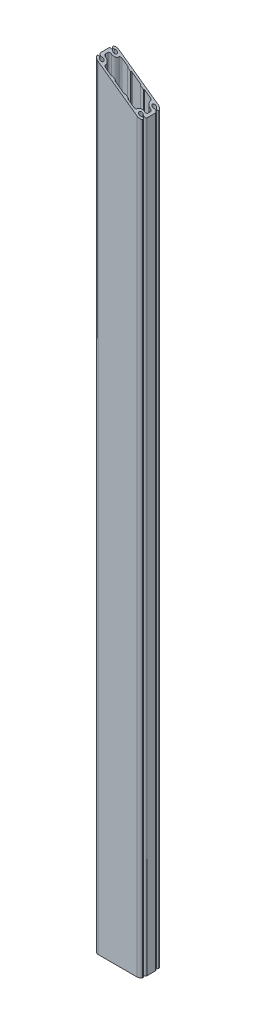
from build123d import *

# Parameters (mm, degrees)
SALIENTE_EXTRUIR1_DEPTH = 3000
CORTAR_EXTRUIR1_DEPTH   = 3003.41569407


with BuildPart() as part:
    # Croquis2 → Saliente-Extruir1 (new body)
    with BuildSketch(Plane(origin=(0, 0, 0), x_dir=(1, 0, 0), z_dir=(0, 1, 0))):
        with BuildLine():
            Line((90, -15.820430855), (90, 15.820430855))
            ThreePointArc((90, 15.820430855), (86.377431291, 21.479059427), (79.722019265, 20.557879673))
            ThreePointArc((79.722019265, 20.557879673), (69.104845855, 26.662756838), (81.19143785, 28.639671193))
            ThreePointArc((81.19143785, 28.639671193), (86.625966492, 27.069353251), (88.196284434, 32.503881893))
            ThreePointArc((88.196284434, 32.503881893), (82.872032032, 37.986118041), (75.5, 40))
            Line((75.5, 40), (-75.5, 40))
            ThreePointArc((-75.5, 40), (-82.872032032, 37.986118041), (-88.196284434, 32.503881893))
            ThreePointArc((-88.196284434, 32.503881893), (-86.625966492, 27.069353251), (-81.19143785, 28.639671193))
            ThreePointArc((-81.19143785, 28.639671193), (-69.104845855, 26.662756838), (-79.722019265, 20.557879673))
            ThreePointArc((-79.722019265, 20.557879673), (-86.377431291, 21.479059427), (-90, 15.820430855))
            Line((-90, 15.820430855), (-90, -15.820430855))
            ThreePointArc((-90, -15.820430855), (-86.377431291, -21.479059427), (-79.722019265, -20.557879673))
            ThreePointArc((-79.722019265, -20.557879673), (-69.104845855, -26.662756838), (-81.19143785, -28.639671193))
            ThreePointArc((-81.19143785, -28.639671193), (-86.625966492, -27.069353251), (-88.196284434, -32.503881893))
            ThreePointArc((-88.196284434, -32.503881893), (-82.872032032, -37.986118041), (-75.5, -40))
            Line((-75.5, -40), (75.5, -40))
            ThreePointArc((75.5, -40), (82.872032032, -37.986118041), (88.196284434, -32.503881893))
            ThreePointArc((88.196284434, -32.503881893), (86.625966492, -27.069353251), (81.19143785, -28.639671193))
            ThreePointArc((81.19143785, -28.639671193), (69.104845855, -26.662756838), (79.722019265, -20.557879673))
            ThreePointArc((79.722019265, -20.557879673), (86.377431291, -21.479059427), (90, -15.820430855))
        make_face()
        with BuildLine():
            Line((-17.482701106, 32), (17.482701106, 32))
            Line((17.482701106, 32), (20, 29))
            Line((20, 29), (30, 29))
            Line((30, 29), (32.517298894, 32))
            Line((32.517298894, 32), (54.5, 32))
            ThreePointArc((54.5, 32), (59.096194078, 30.096194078), (61, 25.5))
            ThreePointArc((61, 25.5), (65.246951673, 15.246951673), (75.5, 11))
            ThreePointArc((75.5, 11), (80.096194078, 9.096194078), (82, 4.5))
            Line((82, 4.5), (82, -4.5))
            ThreePointArc((82, -4.5), (80.096194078, -9.096194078), (75.5, -11))
            ThreePointArc((75.5, -11), (65.246951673, -15.246951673), (61, -25.5))
            ThreePointArc((61, -25.5), (59.096194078, -30.096194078), (54.5, -32))
            Line((54.5, -32), (32.517298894, -32))
            Line((32.517298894, -32), (30, -29))
            Line((30, -29), (20, -29))
            Line((20, -29), (17.482701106, -32))
            Line((17.482701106, -32), (-17.482701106, -32))
            Line((-17.482701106, -32), (-20, -29))
            Line((-20, -29), (-30, -29))
            Line((-30, -29), (-32.517298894, -32))
            Line((-32.517298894, -32), (-54.5, -32))
            ThreePointArc((-54.5, -32), (-59.096194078, -30.096194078), (-61, -25.5))
            ThreePointArc((-61, -25.5), (-65.246951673, -15.246951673), (-75.5, -11))
            ThreePointArc((-75.5, -11), (-80.096194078, -9.096194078), (-82, -4.5))
            Line((-82, -4.5), (-82, 4.5))
            ThreePointArc((-82, 4.5), (-80.096194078, 9.096194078), (-75.5, 11))
            ThreePointArc((-75.5, 11), (-65.246951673, 15.246951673), (-61, 25.5))
            ThreePointArc((-61, 25.5), (-59.096194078, 30.096194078), (-54.5, 32))
            Line((-54.5, 32), (-32.517298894, 32))
            Line((-32.517298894, 32), (-30, 29))
            Line((-30, 29), (-20, 29))
            Line((-20, 29), (-17.482701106, 32))
        make_face(mode=Mode.SUBTRACT)
    extrude(amount=SALIENTE_EXTRUIR1_DEPTH)

    # Croquis3 → Cortar-Extruir1 (cut, through all)
    with BuildSketch(Plane.XY.offset(40)):
        Polygon((90, 3000), (90, 2871.891435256), (-90, 3000), align=None)
    extrude(amount=-CORTAR_EXTRUIR1_DEPTH, mode=Mode.SUBTRACT)


solid = part.part
